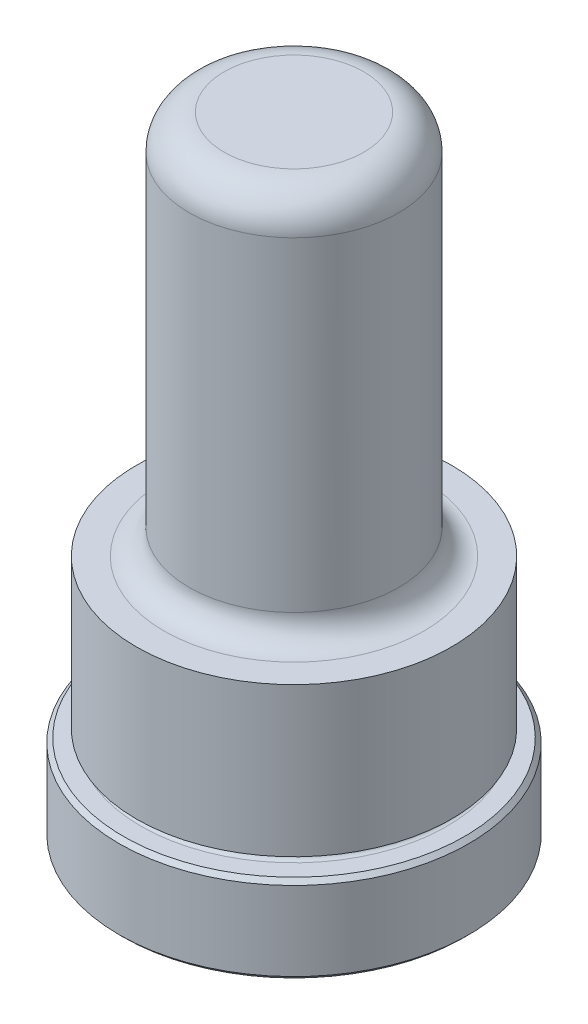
from build123d import *

# Parameters (mm, degrees)
CHAMFER1_SIZE = 0.381
FILLET1_R     = 3.175


with BuildPart() as part:
    # Sketch1 → Revolve1 (revolve)
    with BuildSketch(Plane(origin=(0, 0, 0), x_dir=(0, 0, -1), z_dir=(1, 0, 0)), mode=Mode.PRIVATE) as revolve1_sk:
        with BuildLine():
            Line((0, 0), (15.875, 0))
            Line((15.875, 0), (15.875, 7.9248))
            Line((15.875, 7.9248), (13.8938, 7.9248))
            ThreePointArc((13.8938, 7.9248), (13.5128, 8.3058), (13.8938, 8.6868))
            Line((13.8938, 8.6868), (14.3002, 8.6868))
            Line((14.3002, 8.6868), (14.3002, 22.225))
            Line((14.3002, 22.225), (11.7983, 22.225))
            ThreePointArc((11.7983, 22.225), (10.181853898, 22.894553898), (9.5123, 24.511))
            Line((9.5123, 24.511), (9.5123, 57.15))
            Line((9.5123, 57.15), (0, 57.15))
            Line((0, 57.15), (0, 0))
        make_face()
    revolve(revolve1_sk.sketch.rotate(Axis((0, 0, 0), (0, -1, 0)), 180), axis=Axis((0, 0, 0), (0, -1, 0)))

    # Chamfer1
    chamfer1_edges = [part.edges().sort_by_distance(p)[0] for p in [
        (0, 7.9248, -15.875),
        (0, 0, -15.875),
    ]]
    chamfer(chamfer1_edges, length=CHAMFER1_SIZE)

    # Fillet1
    fillet1_edges = [part.edges().sort_by_distance(p)[0] for p in [
        (0, 57.15, -9.5123),
    ]]
    fillet(fillet1_edges, radius=FILLET1_R)


solid = part.part
